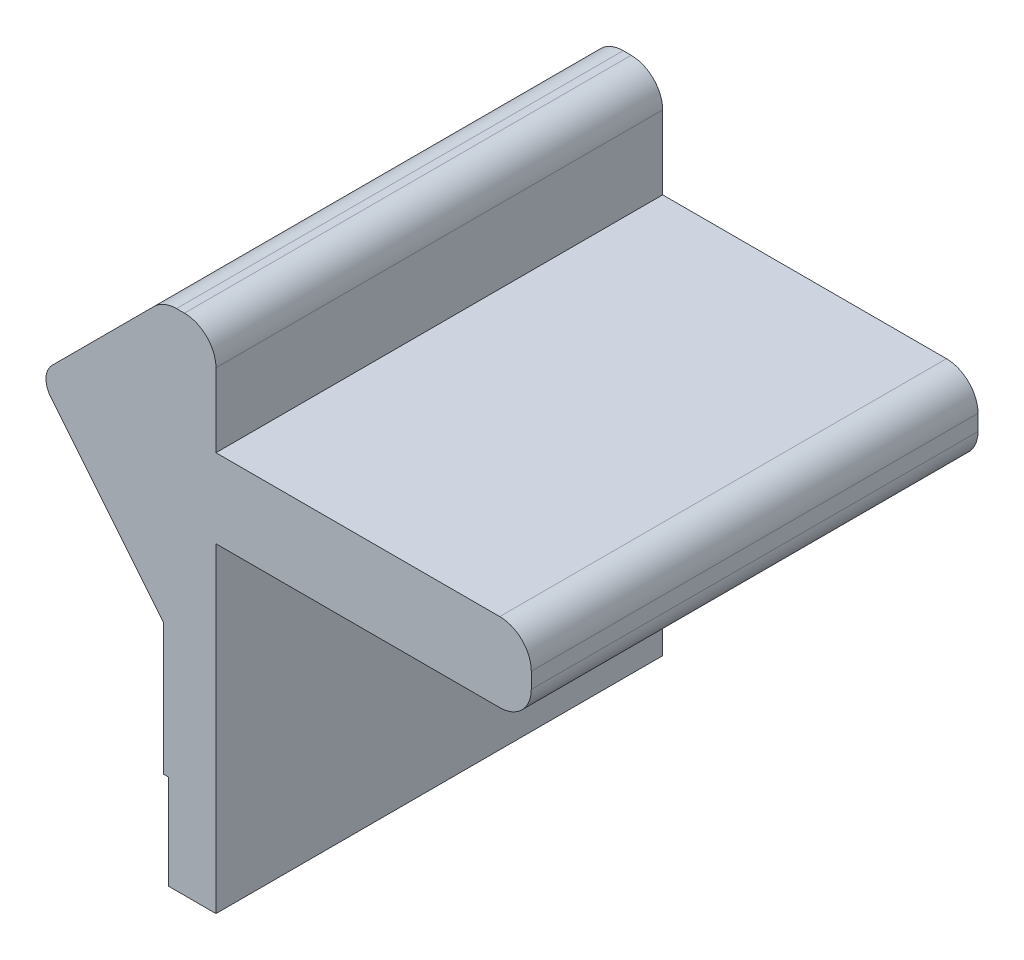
from build123d import *

# Parameters (mm, degrees)
EXTRUDE_1_DEPTH = 8.5
EXTRUDE_2_DEPTH = 0.6


with BuildPart() as part:
    # Sketch 1 → Extrude 1 (new body)
    with BuildSketch(Plane.XY):
        with BuildLine():
            Line((-2.768796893, 6.8), (-1.232879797, 7.055986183))
            ThreePointArc((-1.232879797, 7.055986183), (-1.070725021, 7.011311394), (-1, 6.858707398))
            Line((-1, 6.858707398), (-1, 1.8))
            Line((-1, 1.8), (-0.9, 1.8))
            Line((-0.9, 1.8), (-0.9, 0))
            Line((-0.9, 0), (0, 0))
            Line((0, 0), (0, 6.094799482))
            Line((0, 6.094799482), (5.4, 6.094799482))
            ThreePointArc((5.4, 6.094799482), (5.824264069, 6.270535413), (6, 6.694799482))
            Line((6, 6.694799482), (6, 6.994799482))
            ThreePointArc((6, 6.994799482), (5.824264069, 7.419063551), (5.4, 7.594799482))
            Line((5.4, 7.594799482), (0, 7.594799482))
            Line((0, 7.594799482), (0, 8.994799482))
            ThreePointArc((0, 8.994799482), (-0.175735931, 9.419063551), (-0.6, 9.594799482))
            Line((-0.6, 9.594799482), (-0.751471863, 9.594799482))
            ThreePointArc((-0.751471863, 9.594799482), (-0.878623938, 9.581171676), (-1, 9.540907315))
            ThreePointArc((-1, 9.540907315), (-1.093339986, 9.487877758), (-1.175735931, 9.419063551))
            Line((-1.175735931, 9.419063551), (-3.1173992, 7.477400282))
            ThreePointArc((-3.1173992, 7.477400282), (-3.190223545, 7.011524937), (-2.768796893, 6.8))
        make_face()
    extrude(amount=-EXTRUDE_1_DEPTH)

    # Sketch 1_3 → Extrude 2 (add)
    with BuildSketch(Plane.XY):
        with BuildLine():
            ThreePointArc((-1, 6.858707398), (-1.070725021, 7.011311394), (-1.232879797, 7.055986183))
            Line((-1.232879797, 7.055986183), (-2.768796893, 6.8))
            ThreePointArc((-2.768796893, 6.8), (-2.976169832, 6.820464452), (-3.145110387, 6.94245387))
            Line((-3.145110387, 6.94245387), (-1, 4.3))
            Line((-1, 4.3), (-1, 6.858707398))
        make_face()
    extrude(amount=-EXTRUDE_2_DEPTH)


solid = part.part
